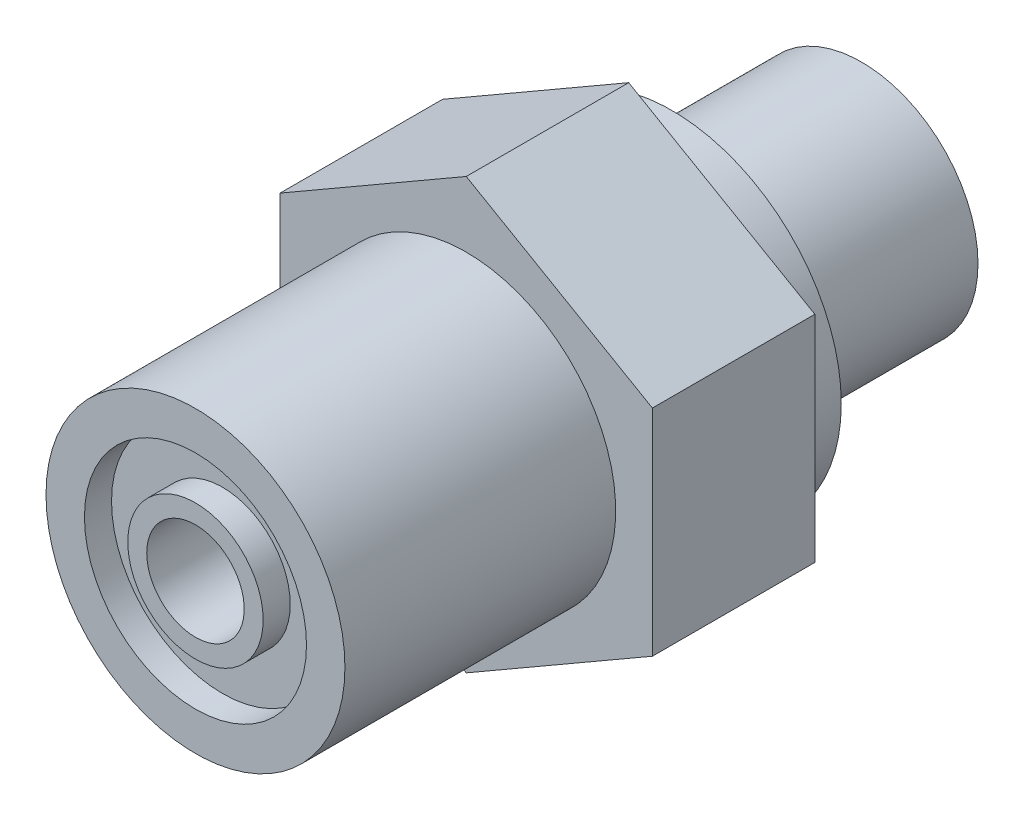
ISO-10303-21;
HEADER;
FILE_DESCRIPTION(('STEP AP214'),'2;1');
FILE_NAME('part.step','',(''),(''),'','','');
FILE_SCHEMA(('AUTOMOTIVE_DESIGN { 1 0 10303 214 1 1 1 1 }'));
ENDSEC;
DATA;
#1=APPLICATION_CONTEXT('core data for automotive mechanical design processes');
#2=APPLICATION_PROTOCOL_DEFINITION('international standard','automotive_design',2000,#1);
#3=PRODUCT_CONTEXT('',#1,'mechanical');
#4=PRODUCT('Part','Part','',(#3));
#5=PRODUCT_RELATED_PRODUCT_CATEGORY('part','',(#4));
#6=PRODUCT_DEFINITION_FORMATION('','',#4);
#7=PRODUCT_DEFINITION_CONTEXT('part definition',#1,'design');
#8=PRODUCT_DEFINITION('design','',#6,#7);
#9=PRODUCT_DEFINITION_SHAPE('','',#8);
#10=(LENGTH_UNIT() NAMED_UNIT(*) SI_UNIT(.MILLI.,.METRE.));
#11=(NAMED_UNIT(*) PLANE_ANGLE_UNIT() SI_UNIT($,.RADIAN.));
#12=(NAMED_UNIT(*) SI_UNIT($,.STERADIAN.) SOLID_ANGLE_UNIT());
#13=UNCERTAINTY_MEASURE_WITH_UNIT(LENGTH_MEASURE(1.E-05),#10,'distance_accuracy_value','');
#14=(GEOMETRIC_REPRESENTATION_CONTEXT(3) GLOBAL_UNCERTAINTY_ASSIGNED_CONTEXT((#13)) GLOBAL_UNIT_ASSIGNED_CONTEXT((#10,
#11,#12)) REPRESENTATION_CONTEXT('',''));
#15=CARTESIAN_POINT('',(0.,0.,0.));
#16=DIRECTION('',(0.,0.,1.));
#17=DIRECTION('',(1.,0.,0.));
#18=AXIS2_PLACEMENT_3D('',#15,#16,#17);
#19=CARTESIAN_POINT('',(0.,0.,31.2419999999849));
#20=DIRECTION('',(0.,0.,1.));
#21=DIRECTION('',(1.00000000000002,0.,0.));
#22=AXIS2_PLACEMENT_3D('',#19,#20,#21);
#23=PLANE('',#22);
#24=CARTESIAN_POINT('',(0.,0.,31.2419999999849));
#25=DIRECTION('',(0.,0.,-1.));
#26=DIRECTION('',(-1.00000000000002,0.,0.));
#27=AXIS2_PLACEMENT_3D('',#24,#25,#26);
#28=CIRCLE('',#27,2.286);
#29=CARTESIAN_POINT('',(-2.28600000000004,0.,31.2419999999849));
#30=VERTEX_POINT('',#29);
#31=EDGE_CURVE('E111',#30,#30,#28,.T.);
#32=ORIENTED_EDGE('',*,*,#31,.T.);
#33=EDGE_LOOP('',(#32));
#34=FACE_BOUND('',#33,.T.);
#35=CARTESIAN_POINT('',(0.,0.,31.2419999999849));
#36=DIRECTION('',(0.,0.,1.));
#37=DIRECTION('',(1.00000000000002,0.,0.));
#38=AXIS2_PLACEMENT_3D('',#35,#36,#37);
#39=CIRCLE('',#38,3.175);
#40=CARTESIAN_POINT('',(3.17500000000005,0.,31.2419999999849));
#41=VERTEX_POINT('',#40);
#42=EDGE_CURVE('E210',#41,#41,#39,.T.);
#43=ORIENTED_EDGE('',*,*,#42,.T.);
#44=EDGE_LOOP('',(#43));
#45=FACE_BOUND('',#44,.T.);
#46=ADVANCED_FACE('F30',(#34,#45),#23,.T.);
#47=CARTESIAN_POINT('',(-8.73124185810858,-5.04098718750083,18.5419999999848));
#48=DIRECTION('',(0.,0.,-1.));
#49=DIRECTION('',(-1.00000000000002,0.,0.));
#50=AXIS2_PLACEMENT_3D('',#47,#48,#49);
#51=PLANE('',#50);
#52=DIRECTION('',(0.,-1.,0.));
#53=VECTOR('',#52,1.);
#54=CARTESIAN_POINT('',(-8.73124185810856,5.0409871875,18.5419999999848));
#55=LINE('',#54,#53);
#56=CARTESIAN_POINT('',(-8.73124185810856,5.0409871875,18.5419999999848));
#57=VERTEX_POINT('',#56);
#58=CARTESIAN_POINT('',(-8.73124185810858,-5.04098718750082,18.5419999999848));
#59=VERTEX_POINT('',#58);
#60=EDGE_CURVE('E122',#57,#59,#55,.T.);
#61=ORIENTED_EDGE('',*,*,#60,.T.);
#62=DIRECTION('',(0.866025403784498,-0.499999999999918,0.));
#63=VECTOR('',#62,1.);
#64=CARTESIAN_POINT('',(4.07094578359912E-06,-10.081974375,18.5419999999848));
#65=LINE('',#64,#63);
#66=CARTESIAN_POINT('',(4.07094578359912E-06,-10.081974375,18.5419999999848));
#67=VERTEX_POINT('',#66);
#68=EDGE_CURVE('E99',#59,#67,#65,.T.);
#69=ORIENTED_EDGE('',*,*,#68,.T.);
#70=DIRECTION('',(0.866025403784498,0.499999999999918,0.));
#71=VECTOR('',#70,1.);
#72=CARTESIAN_POINT('',(4.07094578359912E-06,-10.081974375,18.5419999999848));
#73=LINE('',#72,#71);
#74=CARTESIAN_POINT('',(8.73125000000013,-5.04098718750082,18.5419999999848));
#75=VERTEX_POINT('',#74);
#76=EDGE_CURVE('E125',#67,#75,#73,.T.);
#77=ORIENTED_EDGE('',*,*,#76,.T.);
#78=DIRECTION('',(0.,1.,0.));
#79=VECTOR('',#78,1.);
#80=CARTESIAN_POINT('',(8.73125000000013,5.0409871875,18.5419999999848));
#81=LINE('',#80,#79);
#82=CARTESIAN_POINT('',(8.73125000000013,5.0409871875,18.5419999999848));
#83=VERTEX_POINT('',#82);
#84=EDGE_CURVE('E127',#75,#83,#81,.T.);
#85=ORIENTED_EDGE('',*,*,#84,.T.);
#86=DIRECTION('',(-0.866025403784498,0.499999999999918,0.));
#87=VECTOR('',#86,1.);
#88=CARTESIAN_POINT('',(4.07094576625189E-06,10.0819743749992,18.5419999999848));
#89=LINE('',#88,#87);
#90=CARTESIAN_POINT('',(4.07094576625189E-06,10.0819743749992,18.5419999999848));
#91=VERTEX_POINT('',#90);
#92=EDGE_CURVE('E50',#83,#91,#89,.T.);
#93=ORIENTED_EDGE('',*,*,#92,.T.);
#94=DIRECTION('',(-0.866025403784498,-0.499999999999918,0.));
#95=VECTOR('',#94,1.);
#96=CARTESIAN_POINT('',(4.07094576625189E-06,10.0819743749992,18.5419999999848));
#97=LINE('',#96,#95);
#98=EDGE_CURVE('E45',#91,#57,#97,.T.);
#99=ORIENTED_EDGE('',*,*,#98,.T.);
#100=EDGE_LOOP('',(#61,#69,#77,#85,#93,#99));
#101=FACE_BOUND('',#100,.T.);
#102=CARTESIAN_POINT('',(0.,0.,18.5419999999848));
#103=DIRECTION('',(0.,0.,-1.));
#104=DIRECTION('',(-1.00000000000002,0.,0.));
#105=AXIS2_PLACEMENT_3D('',#102,#103,#104);
#106=CIRCLE('',#105,7.0104);
#107=CARTESIAN_POINT('',(-7.01040000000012,0.,18.5419999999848));
#108=VERTEX_POINT('',#107);
#109=EDGE_CURVE('E11',#108,#108,#106,.F.);
#110=ORIENTED_EDGE('',*,*,#109,.F.);
#111=EDGE_LOOP('',(#110));
#112=FACE_BOUND('',#111,.T.);
#113=ADVANCED_FACE('F157',(#101,#112),#51,.F.);
#114=CARTESIAN_POINT('',(0.,0.,8.89));
#115=DIRECTION('',(0.,0.,-1.));
#116=DIRECTION('',(-1.00000000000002,0.,0.));
#117=AXIS2_PLACEMENT_3D('',#114,#115,#116);
#118=CYLINDRICAL_SURFACE('',#117,5.461);
#119=CARTESIAN_POINT('',(0.,0.,8.89));
#120=DIRECTION('',(0.,0.,1.));
#121=DIRECTION('',(1.00000000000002,0.,0.));
#122=AXIS2_PLACEMENT_3D('',#119,#120,#121);
#123=CIRCLE('',#122,5.461);
#124=CARTESIAN_POINT('',(5.46100000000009,0.,8.89));
#125=VERTEX_POINT('',#124);
#126=EDGE_CURVE('E38',#125,#125,#123,.T.);
#127=ORIENTED_EDGE('',*,*,#126,.F.);
#128=EDGE_LOOP('',(#127));
#129=FACE_BOUND('',#128,.T.);
#130=CARTESIAN_POINT('',(0.,0.,0.));
#131=DIRECTION('',(0.,0.,1.));
#132=DIRECTION('',(1.00000000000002,0.,0.));
#133=AXIS2_PLACEMENT_3D('',#130,#131,#132);
#134=CIRCLE('',#133,5.461);
#135=CARTESIAN_POINT('',(5.46100000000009,0.,0.));
#136=VERTEX_POINT('',#135);
#137=EDGE_CURVE('E147',#136,#136,#134,.T.);
#138=ORIENTED_EDGE('',*,*,#137,.T.);
#139=EDGE_LOOP('',(#138));
#140=FACE_BOUND('',#139,.T.);
#141=ADVANCED_FACE('F32',(#129,#140),#118,.T.);
#142=CARTESIAN_POINT('',(0.,0.,0.));
#143=DIRECTION('',(0.,0.,1.));
#144=DIRECTION('',(1.00000000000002,0.,0.));
#145=AXIS2_PLACEMENT_3D('',#142,#143,#144);
#146=PLANE('',#145);
#147=CARTESIAN_POINT('',(0.,0.,0.));
#148=DIRECTION('',(0.,0.,-1.));
#149=DIRECTION('',(-1.00000000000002,0.,0.));
#150=AXIS2_PLACEMENT_3D('',#147,#148,#149);
#151=CIRCLE('',#150,2.286);
#152=CARTESIAN_POINT('',(-2.28600000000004,0.,0.));
#153=VERTEX_POINT('',#152);
#154=EDGE_CURVE('E207',#153,#153,#151,.T.);
#155=ORIENTED_EDGE('',*,*,#154,.F.);
#156=EDGE_LOOP('',(#155));
#157=FACE_BOUND('',#156,.T.);
#158=ORIENTED_EDGE('',*,*,#137,.F.);
#159=EDGE_LOOP('',(#158));
#160=FACE_BOUND('',#159,.T.);
#161=ADVANCED_FACE('F156',(#157,#160),#146,.F.);
#162=CARTESIAN_POINT('',(0.,0.,8.89));
#163=DIRECTION('',(0.,0.,1.));
#164=DIRECTION('',(1.00000000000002,0.,0.));
#165=AXIS2_PLACEMENT_3D('',#162,#163,#164);
#166=PLANE('',#165);
#167=CARTESIAN_POINT('',(0.,0.,8.89));
#168=DIRECTION('',(0.,0.,1.));
#169=DIRECTION('',(1.00000000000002,0.,0.));
#170=AXIS2_PLACEMENT_3D('',#167,#168,#169);
#171=CIRCLE('',#170,7.9375);
#172=CARTESIAN_POINT('',(7.93750000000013,0.,8.89));
#173=VERTEX_POINT('',#172);
#174=EDGE_CURVE('E102',#173,#173,#171,.T.);
#175=ORIENTED_EDGE('',*,*,#174,.F.);
#176=EDGE_LOOP('',(#175));
#177=FACE_BOUND('',#176,.T.);
#178=ORIENTED_EDGE('',*,*,#126,.T.);
#179=EDGE_LOOP('',(#178));
#180=FACE_BOUND('',#179,.T.);
#181=ADVANCED_FACE('F152',(#177,#180),#166,.F.);
#182=CARTESIAN_POINT('',(0.,0.,10.922));
#183=DIRECTION('',(0.,0.,-1.));
#184=DIRECTION('',(-1.00000000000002,0.,0.));
#185=AXIS2_PLACEMENT_3D('',#182,#183,#184);
#186=CYLINDRICAL_SURFACE('',#185,7.9375);
#187=CARTESIAN_POINT('',(0.,0.,10.922));
#188=DIRECTION('',(0.,0.,1.));
#189=DIRECTION('',(1.00000000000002,0.,0.));
#190=AXIS2_PLACEMENT_3D('',#187,#188,#189);
#191=CIRCLE('',#190,7.9375);
#192=CARTESIAN_POINT('',(7.93750000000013,0.,10.922));
#193=VERTEX_POINT('',#192);
#194=EDGE_CURVE('E144',#193,#193,#191,.T.);
#195=ORIENTED_EDGE('',*,*,#194,.F.);
#196=EDGE_LOOP('',(#195));
#197=FACE_BOUND('',#196,.T.);
#198=ORIENTED_EDGE('',*,*,#174,.T.);
#199=EDGE_LOOP('',(#198));
#200=FACE_BOUND('',#199,.T.);
#201=ADVANCED_FACE('F165',(#197,#200),#186,.T.);
#202=CARTESIAN_POINT('',(-8.73124185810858,-5.04098718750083,10.9219999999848));
#203=DIRECTION('',(0.,0.,-1.));
#204=DIRECTION('',(-1.00000000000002,0.,0.));
#205=AXIS2_PLACEMENT_3D('',#202,#203,#204);
#206=PLANE('',#205);
#207=DIRECTION('',(0.,-1.,0.));
#208=VECTOR('',#207,1.);
#209=CARTESIAN_POINT('',(-8.73124185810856,5.0409871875,10.9219999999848));
#210=LINE('',#209,#208);
#211=CARTESIAN_POINT('',(-8.73124185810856,5.0409871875,10.9219999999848));
#212=VERTEX_POINT('',#211);
#213=CARTESIAN_POINT('',(-8.73124185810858,-5.04098718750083,10.9219999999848));
#214=VERTEX_POINT('',#213);
#215=EDGE_CURVE('E89',#212,#214,#210,.T.);
#216=ORIENTED_EDGE('',*,*,#215,.F.);
#217=DIRECTION('',(-0.866025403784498,-0.499999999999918,0.));
#218=VECTOR('',#217,1.);
#219=CARTESIAN_POINT('',(4.07094576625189E-06,10.0819743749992,10.9219999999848));
#220=LINE('',#219,#218);
#221=CARTESIAN_POINT('',(4.07094576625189E-06,10.0819743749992,10.9219999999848));
#222=VERTEX_POINT('',#221);
#223=EDGE_CURVE('E120',#222,#212,#220,.T.);
#224=ORIENTED_EDGE('',*,*,#223,.F.);
#225=DIRECTION('',(-0.866025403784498,0.499999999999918,0.));
#226=VECTOR('',#225,1.);
#227=CARTESIAN_POINT('',(4.07094576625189E-06,10.0819743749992,10.9219999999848));
#228=LINE('',#227,#226);
#229=CARTESIAN_POINT('',(8.73125000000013,5.0409871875,10.9219999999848));
#230=VERTEX_POINT('',#229);
#231=EDGE_CURVE('E118',#230,#222,#228,.T.);
#232=ORIENTED_EDGE('',*,*,#231,.F.);
#233=DIRECTION('',(0.,1.,0.));
#234=VECTOR('',#233,1.);
#235=CARTESIAN_POINT('',(8.73125000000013,5.0409871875,10.9219999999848));
#236=LINE('',#235,#234);
#237=CARTESIAN_POINT('',(8.73125000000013,-5.04098718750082,10.9219999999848));
#238=VERTEX_POINT('',#237);
#239=EDGE_CURVE('E116',#238,#230,#236,.T.);
#240=ORIENTED_EDGE('',*,*,#239,.F.);
#241=DIRECTION('',(0.866025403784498,0.499999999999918,0.));
#242=VECTOR('',#241,1.);
#243=CARTESIAN_POINT('',(4.07094578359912E-06,-10.081974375,10.9219999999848));
#244=LINE('',#243,#242);
#245=CARTESIAN_POINT('',(4.07094578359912E-06,-10.081974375,10.9219999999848));
#246=VERTEX_POINT('',#245);
#247=EDGE_CURVE('E91',#246,#238,#244,.T.);
#248=ORIENTED_EDGE('',*,*,#247,.F.);
#249=DIRECTION('',(0.866025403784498,-0.499999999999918,0.));
#250=VECTOR('',#249,1.);
#251=CARTESIAN_POINT('',(4.07094578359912E-06,-10.081974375,10.9219999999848));
#252=LINE('',#251,#250);
#253=EDGE_CURVE('E83',#214,#246,#252,.T.);
#254=ORIENTED_EDGE('',*,*,#253,.F.);
#255=EDGE_LOOP('',(#216,#224,#232,#240,#248,#254));
#256=FACE_BOUND('',#255,.T.);
#257=ORIENTED_EDGE('',*,*,#194,.T.);
#258=EDGE_LOOP('',(#257));
#259=FACE_BOUND('',#258,.T.);
#260=ADVANCED_FACE('F85',(#256,#259),#206,.T.);
#261=CARTESIAN_POINT('',(-8.73124185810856,5.0409871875,18.5419999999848));
#262=DIRECTION('',(1.00000000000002,0.,0.));
#263=DIRECTION('',(0.,0.,-1.));
#264=AXIS2_PLACEMENT_3D('',#261,#262,#263);
#265=PLANE('',#264);
#266=ORIENTED_EDGE('',*,*,#215,.T.);
#267=DIRECTION('',(0.,0.,-1.));
#268=VECTOR('',#267,1.);
#269=CARTESIAN_POINT('',(-8.73124185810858,-5.04098718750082,18.5419999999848));
#270=LINE('',#269,#268);
#271=EDGE_CURVE('E97',#59,#214,#270,.T.);
#272=ORIENTED_EDGE('',*,*,#271,.F.);
#273=ORIENTED_EDGE('',*,*,#60,.F.);
#274=DIRECTION('',(0.,0.,-1.));
#275=VECTOR('',#274,1.);
#276=CARTESIAN_POINT('',(-8.73124185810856,5.0409871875,18.5419999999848));
#277=LINE('',#276,#275);
#278=EDGE_CURVE('E107',#57,#212,#277,.T.);
#279=ORIENTED_EDGE('',*,*,#278,.T.);
#280=EDGE_LOOP('',(#266,#272,#273,#279));
#281=FACE_BOUND('',#280,.T.);
#282=ADVANCED_FACE('F106',(#281),#265,.F.);
#283=CARTESIAN_POINT('',(4.07094578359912E-06,-10.081974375,18.5419999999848));
#284=DIRECTION('',(0.499999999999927,0.866025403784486,0.));
#285=DIRECTION('',(-0.866025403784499,0.499999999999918,0.));
#286=AXIS2_PLACEMENT_3D('',#283,#284,#285);
#287=PLANE('',#286);
#288=ORIENTED_EDGE('',*,*,#253,.T.);
#289=DIRECTION('',(0.,0.,-1.));
#290=VECTOR('',#289,1.);
#291=CARTESIAN_POINT('',(4.07094578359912E-06,-10.081974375,18.5419999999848));
#292=LINE('',#291,#290);
#293=EDGE_CURVE('E103',#67,#246,#292,.T.);
#294=ORIENTED_EDGE('',*,*,#293,.F.);
#295=ORIENTED_EDGE('',*,*,#68,.F.);
#296=ORIENTED_EDGE('',*,*,#271,.T.);
#297=EDGE_LOOP('',(#288,#294,#295,#296));
#298=FACE_BOUND('',#297,.T.);
#299=ADVANCED_FACE('F98',(#298),#287,.F.);
#300=CARTESIAN_POINT('',(4.07094578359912E-06,-10.081974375,18.5419999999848));
#301=DIRECTION('',(-0.499999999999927,0.866025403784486,0.));
#302=DIRECTION('',(-0.866025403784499,-0.499999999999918,0.));
#303=AXIS2_PLACEMENT_3D('',#300,#301,#302);
#304=PLANE('',#303);
#305=ORIENTED_EDGE('',*,*,#247,.T.);
#306=DIRECTION('',(0.,0.,-1.));
#307=VECTOR('',#306,1.);
#308=CARTESIAN_POINT('',(8.73125000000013,-5.04098718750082,18.5419999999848));
#309=LINE('',#308,#307);
#310=EDGE_CURVE('E138',#75,#238,#309,.T.);
#311=ORIENTED_EDGE('',*,*,#310,.F.);
#312=ORIENTED_EDGE('',*,*,#76,.F.);
#313=ORIENTED_EDGE('',*,*,#293,.T.);
#314=EDGE_LOOP('',(#305,#311,#312,#313));
#315=FACE_BOUND('',#314,.T.);
#316=ADVANCED_FACE('F282',(#315),#304,.F.);
#317=CARTESIAN_POINT('',(8.73125000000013,5.0409871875,18.5419999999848));
#318=DIRECTION('',(-1.00000000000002,0.,0.));
#319=DIRECTION('',(0.,0.,1.));
#320=AXIS2_PLACEMENT_3D('',#317,#318,#319);
#321=PLANE('',#320);
#322=ORIENTED_EDGE('',*,*,#239,.T.);
#323=DIRECTION('',(0.,0.,-1.));
#324=VECTOR('',#323,1.);
#325=CARTESIAN_POINT('',(8.73125000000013,5.0409871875,18.5419999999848));
#326=LINE('',#325,#324);
#327=EDGE_CURVE('E135',#83,#230,#326,.T.);
#328=ORIENTED_EDGE('',*,*,#327,.F.);
#329=ORIENTED_EDGE('',*,*,#84,.F.);
#330=ORIENTED_EDGE('',*,*,#310,.T.);
#331=EDGE_LOOP('',(#322,#328,#329,#330));
#332=FACE_BOUND('',#331,.T.);
#333=ADVANCED_FACE('F274',(#332),#321,.F.);
#334=CARTESIAN_POINT('',(4.07094576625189E-06,10.0819743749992,18.5419999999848));
#335=DIRECTION('',(-0.499999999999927,-0.866025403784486,0.));
#336=DIRECTION('',(0.866025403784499,-0.499999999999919,0.));
#337=AXIS2_PLACEMENT_3D('',#334,#335,#336);
#338=PLANE('',#337);
#339=ORIENTED_EDGE('',*,*,#231,.T.);
#340=DIRECTION('',(0.,0.,-1.));
#341=VECTOR('',#340,1.);
#342=CARTESIAN_POINT('',(4.07094576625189E-06,10.0819743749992,18.5419999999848));
#343=LINE('',#342,#341);
#344=EDGE_CURVE('E132',#91,#222,#343,.T.);
#345=ORIENTED_EDGE('',*,*,#344,.F.);
#346=ORIENTED_EDGE('',*,*,#92,.F.);
#347=ORIENTED_EDGE('',*,*,#327,.T.);
#348=EDGE_LOOP('',(#339,#345,#346,#347));
#349=FACE_BOUND('',#348,.T.);
#350=ADVANCED_FACE('F266',(#349),#338,.F.);
#351=CARTESIAN_POINT('',(4.07094576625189E-06,10.0819743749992,18.5419999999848));
#352=DIRECTION('',(0.499999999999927,-0.866025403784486,0.));
#353=DIRECTION('',(0.866025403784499,0.499999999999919,0.));
#354=AXIS2_PLACEMENT_3D('',#351,#352,#353);
#355=PLANE('',#354);
#356=ORIENTED_EDGE('',*,*,#223,.T.);
#357=ORIENTED_EDGE('',*,*,#278,.F.);
#358=ORIENTED_EDGE('',*,*,#98,.F.);
#359=ORIENTED_EDGE('',*,*,#344,.T.);
#360=EDGE_LOOP('',(#356,#357,#358,#359));
#361=FACE_BOUND('',#360,.T.);
#362=ADVANCED_FACE('F192',(#361),#355,.F.);
#363=CARTESIAN_POINT('',(0.,0.,31.2419999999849));
#364=DIRECTION('',(0.,0.,-1.));
#365=DIRECTION('',(-1.00000000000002,0.,0.));
#366=AXIS2_PLACEMENT_3D('',#363,#364,#365);
#367=CYLINDRICAL_SURFACE('',#366,7.0104);
#368=CARTESIAN_POINT('',(0.,0.,31.2419999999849));
#369=DIRECTION('',(0.,0.,1.));
#370=DIRECTION('',(1.00000000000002,0.,0.));
#371=AXIS2_PLACEMENT_3D('',#368,#369,#370);
#372=CIRCLE('',#371,7.0104);
#373=CARTESIAN_POINT('',(7.01040000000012,0.,31.2419999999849));
#374=VERTEX_POINT('',#373);
#375=EDGE_CURVE('E108',#374,#374,#372,.T.);
#376=ORIENTED_EDGE('',*,*,#375,.F.);
#377=EDGE_LOOP('',(#376));
#378=FACE_BOUND('',#377,.T.);
#379=ORIENTED_EDGE('',*,*,#109,.T.);
#380=EDGE_LOOP('',(#379));
#381=FACE_BOUND('',#380,.T.);
#382=ADVANCED_FACE('F184',(#378,#381),#367,.T.);
#383=CARTESIAN_POINT('',(0.,0.,31.2419999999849));
#384=DIRECTION('',(0.,0.,1.));
#385=DIRECTION('',(1.00000000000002,0.,0.));
#386=AXIS2_PLACEMENT_3D('',#383,#384,#385);
#387=CIRCLE('',#386,5.207);
#388=CARTESIAN_POINT('',(5.20700000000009,0.,31.2419999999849));
#389=VERTEX_POINT('',#388);
#390=EDGE_CURVE('E197',#389,#389,#387,.T.);
#391=ORIENTED_EDGE('',*,*,#390,.F.);
#392=EDGE_LOOP('',(#391));
#393=FACE_BOUND('',#392,.T.);
#394=ORIENTED_EDGE('',*,*,#375,.T.);
#395=EDGE_LOOP('',(#394));
#396=FACE_BOUND('',#395,.T.);
#397=ADVANCED_FACE('F173',(#393,#396),#23,.T.);
#398=CARTESIAN_POINT('',(0.,0.,31.2419999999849));
#399=DIRECTION('',(0.,0.,-1.));
#400=DIRECTION('',(-1.00000000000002,0.,0.));
#401=AXIS2_PLACEMENT_3D('',#398,#399,#400);
#402=CYLINDRICAL_SURFACE('',#401,2.286);
#403=ORIENTED_EDGE('',*,*,#31,.F.);
#404=EDGE_LOOP('',(#403));
#405=FACE_BOUND('',#404,.T.);
#406=ORIENTED_EDGE('',*,*,#154,.T.);
#407=EDGE_LOOP('',(#406));
#408=FACE_BOUND('',#407,.T.);
#409=ADVANCED_FACE('F183',(#405,#408),#402,.F.);
#410=CARTESIAN_POINT('',(0.,0.,29.9719999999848));
#411=DIRECTION('',(0.,0.,1.));
#412=DIRECTION('',(1.00000000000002,0.,0.));
#413=AXIS2_PLACEMENT_3D('',#410,#411,#412);
#414=CYLINDRICAL_SURFACE('',#413,5.207);
#415=CARTESIAN_POINT('',(0.,0.,29.9719999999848));
#416=DIRECTION('',(0.,0.,1.));
#417=DIRECTION('',(1.00000000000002,0.,0.));
#418=AXIS2_PLACEMENT_3D('',#415,#416,#417);
#419=CIRCLE('',#418,5.207);
#420=CARTESIAN_POINT('',(5.20700000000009,0.,29.9719999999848));
#421=VERTEX_POINT('',#420);
#422=EDGE_CURVE('E203',#421,#421,#419,.T.);
#423=ORIENTED_EDGE('',*,*,#422,.F.);
#424=EDGE_LOOP('',(#423));
#425=FACE_BOUND('',#424,.T.);
#426=ORIENTED_EDGE('',*,*,#390,.T.);
#427=EDGE_LOOP('',(#426));
#428=FACE_BOUND('',#427,.T.);
#429=ADVANCED_FACE('F190',(#425,#428),#414,.F.);
#430=CARTESIAN_POINT('',(0.,0.,29.9719999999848));
#431=DIRECTION('',(0.,0.,1.));
#432=DIRECTION('',(1.00000000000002,0.,0.));
#433=AXIS2_PLACEMENT_3D('',#430,#431,#432);
#434=PLANE('',#433);
#435=CARTESIAN_POINT('',(0.,0.,29.9719999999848));
#436=DIRECTION('',(0.,0.,1.));
#437=DIRECTION('',(1.00000000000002,0.,0.));
#438=AXIS2_PLACEMENT_3D('',#435,#436,#437);
#439=CIRCLE('',#438,3.175);
#440=CARTESIAN_POINT('',(3.17500000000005,0.,29.9719999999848));
#441=VERTEX_POINT('',#440);
#442=EDGE_CURVE('E204',#441,#441,#439,.T.);
#443=ORIENTED_EDGE('',*,*,#442,.F.);
#444=EDGE_LOOP('',(#443));
#445=FACE_BOUND('',#444,.T.);
#446=ORIENTED_EDGE('',*,*,#422,.T.);
#447=EDGE_LOOP('',(#446));
#448=FACE_BOUND('',#447,.T.);
#449=ADVANCED_FACE('F222',(#445,#448),#434,.T.);
#450=CARTESIAN_POINT('',(0.,0.,29.9719999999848));
#451=DIRECTION('',(0.,0.,1.));
#452=DIRECTION('',(1.00000000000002,0.,0.));
#453=AXIS2_PLACEMENT_3D('',#450,#451,#452);
#454=CYLINDRICAL_SURFACE('',#453,3.175);
#455=ORIENTED_EDGE('',*,*,#442,.T.);
#456=EDGE_LOOP('',(#455));
#457=FACE_BOUND('',#456,.T.);
#458=ORIENTED_EDGE('',*,*,#42,.F.);
#459=EDGE_LOOP('',(#458));
#460=FACE_BOUND('',#459,.T.);
#461=ADVANCED_FACE('F220',(#457,#460),#454,.T.);
#462=CLOSED_SHELL('',(#46,#113,#141,#161,#181,#201,#260,#282,#299,#316,#333,#350,#362,#382,#397,
#409,#429,#449,#461));
#463=MANIFOLD_SOLID_BREP('B2',#462);
#464=ADVANCED_BREP_SHAPE_REPRESENTATION('',(#18,#463),#14);
#465=SHAPE_DEFINITION_REPRESENTATION(#9,#464);
ENDSEC;
END-ISO-10303-21;
